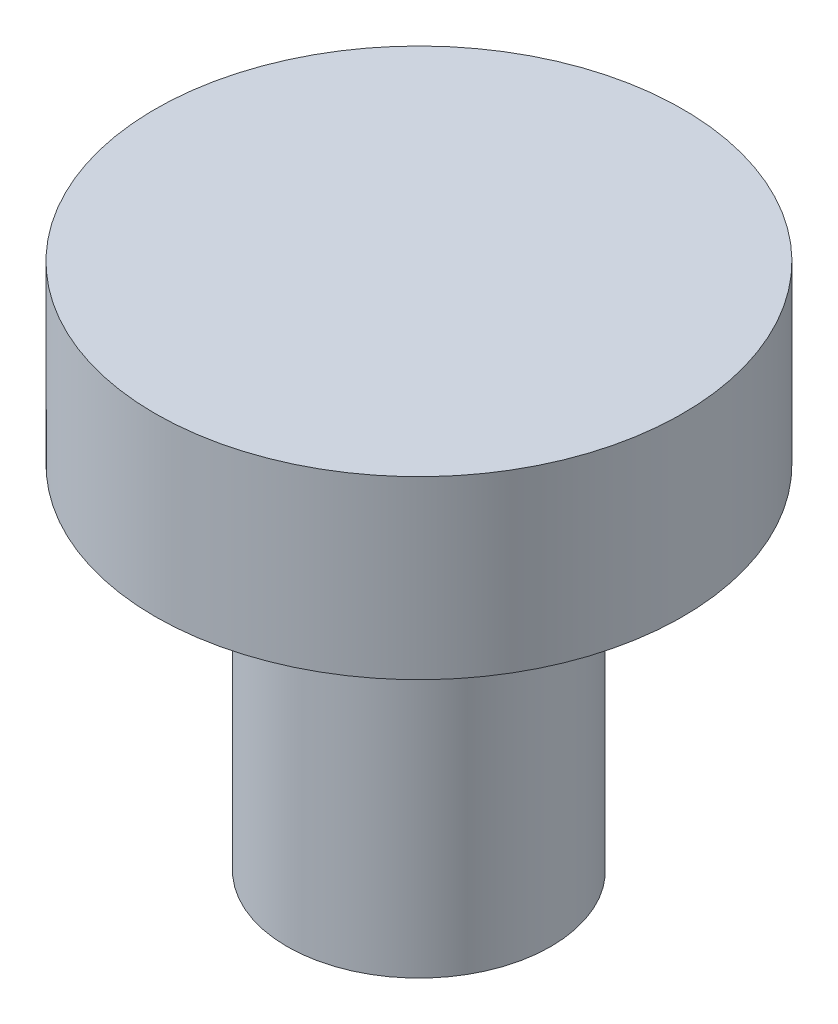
from build123d import *

# Parameters (mm, degrees)
SKETCH1_R           = 7.5
BOSS_EXTRUDE1_DEPTH = 20
SKETCH2_R           = 15
BOSS_EXTRUDE2_DEPTH = 10


with BuildPart() as part:
    # Sketch1 → Boss-Extrude1 (new body)
    with BuildSketch(Plane(origin=(0, 0, 0), x_dir=(1, 0, 0), z_dir=(0, 1, 0))):
        with Locations(Location((0, 0, 0), (0, 0, 270))):
            Circle(SKETCH1_R)
    extrude(amount=BOSS_EXTRUDE1_DEPTH)

    # Sketch2 → Boss-Extrude2 (add)
    with BuildSketch(Plane(origin=(0, 20, 0), x_dir=(1, 0, 0), z_dir=(0, 1, 0))):
        with Locations(Location((0, 0, 0), (0, 0, 270))):
            Circle(SKETCH2_R)
    extrude(amount=BOSS_EXTRUDE2_DEPTH)


solid = part.part
